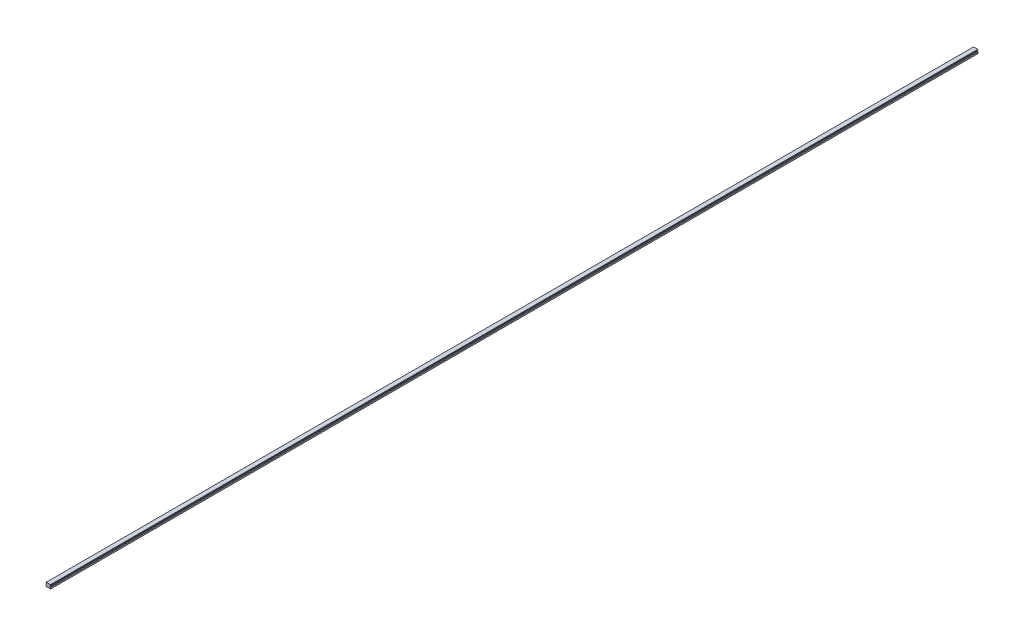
from build123d import *

# Parameters (mm, degrees)
SKETCH1_W           = 20
SKETCH1_H           = 16.3
BOSS_EXTRUDE1_DEPTH = 1970
CUT_EXTRUDE1_DEPTH  = 3941.046407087
CHAMFER1_SIZE       = 1
FILLET1_R           = 1
CUT_EXTRUDE2_DEPTH  = 3941.046407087
SKETCH5_R           = 3
SKETCH5_R_2         = 2.5
CUT_EXTRUDE5_DEPTH  = 10
SKETCH5_2_R         = 2.5
CUT_EXTRUDE6_DEPTH  = 13
LPATTERN2_COUNT     = 66
LPATTERN2_PITCH     = 60


with BuildPart() as part:
    # Sketch1 → Boss-Extrude1 (new, symmetric)
    with BuildSketch(Plane.XY):
        with Locations((0, 8.15)):
            Rectangle(SKETCH1_W, SKETCH1_H)
    extrude(amount=BOSS_EXTRUDE1_DEPTH, both=True)

    # Sketch2 → Cut-Extrude1 (cut, through all)
    with BuildSketch(Plane.XY.offset(1970)):
        Polygon((-10, 14.3), (-10, 7.3), (-7.666666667, 9.633333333), (-7.666666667, 11.966666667), align=None)
        Polygon((7.666666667, 11.966666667), (10, 14.3), (10, 7.3), (7.666666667, 9.633333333), align=None)
    extrude(amount=-CUT_EXTRUDE1_DEPTH, mode=Mode.SUBTRACT)

    # Chamfer1
    chamfer1_edges = [part.edges().sort_by_distance(p)[0] for p in [
        (-10, 16.3, 0),
        (10, 16.3, 0),
        (10, 0, 0),
        (-10, 0, 0),
    ]]
    chamfer(chamfer1_edges, length=CHAMFER1_SIZE)

    # Fillet1
    fillet1_edges = [part.edges().sort_by_distance(p)[0] for p in [
        (-7.666666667, 11.966666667, 0),
        (-7.666666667, 9.633333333, 0),
        (7.666666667, 9.633333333, 0),
        (7.666666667, 11.966666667, 0),
    ]]
    fillet(fillet1_edges, radius=FILLET1_R)

    # Sketch3 → Cut-Extrude2 (cut, through all)
    with BuildSketch(Plane.XY.offset(1970)):
        Polygon((-6, 0), (-5, 1), (5, 1), (6, 0), align=None)
    extrude(amount=-CUT_EXTRUDE2_DEPTH, mode=Mode.SUBTRACT)

    # Sketch5 → Cut-Extrude5 (cut)
    with BuildSketch(Plane.XZ.offset(-1)):
        with Locations(Location((0, 1950, 0), (0, 0, 270))):
            Circle(SKETCH5_R)
        with Locations(Location((0, 1950, 0), (0, 0, 270))):
            Circle(SKETCH5_R_2, mode=Mode.SUBTRACT)
    cut_extrude5 = extrude(amount=-CUT_EXTRUDE5_DEPTH, mode=Mode.SUBTRACT)

    # Sketch5_2 → Cut-Extrude6 (cut)
    with BuildSketch(Plane.XZ.offset(-1)):
        with Locations(Location((0, 1950, 0), (0, 0, 270))):
            Circle(SKETCH5_2_R)
    cut_extrude6 = extrude(amount=-CUT_EXTRUDE6_DEPTH, mode=Mode.SUBTRACT)

    # Cut-Extrude7 cone 1 section (on through the dimple's axis) → Cut-Extrude7 (revolve, cut)
    with BuildSketch(Plane(origin=(0, 14, 1950), x_dir=(0, 0, -1), z_dir=(1, 0, 0))):
        Polygon((0, 0), (2.5, 0), (0, 1.443375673), align=None)
    cut_extrude7 = revolve(axis=Axis((0, 14, 1950), (0, 1, 0)), mode=Mode.SUBTRACT)

    # LPattern2: Cut-Extrude5, Cut-Extrude6, Cut-Extrude7 ×66
    with Locations(*[(0, 0, -i * LPATTERN2_PITCH) for i in range(1, LPATTERN2_COUNT)]):
        add(cut_extrude5, mode=Mode.SUBTRACT)
        add(cut_extrude6, mode=Mode.SUBTRACT)
        add(cut_extrude7, mode=Mode.SUBTRACT)


solid = part.part
